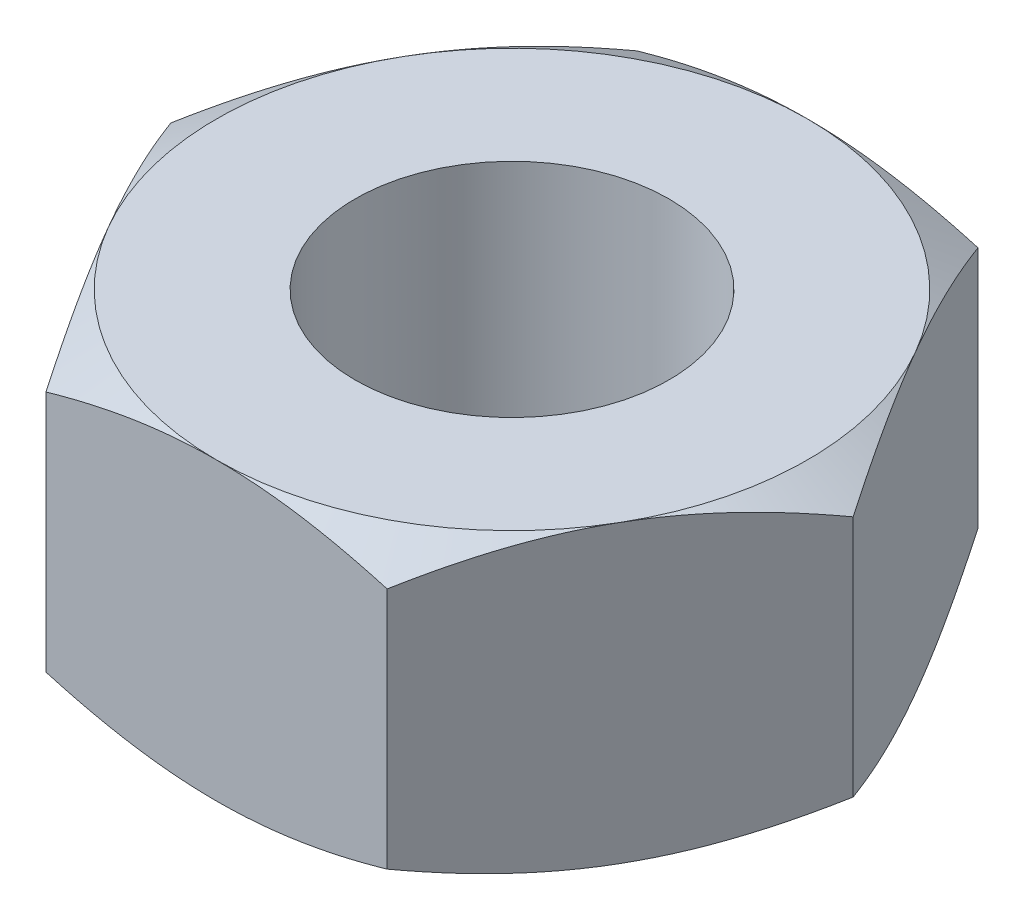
ISO-10303-21;
HEADER;
FILE_DESCRIPTION(('STEP AP214'),'2;1');
FILE_NAME('part.step','',(''),(''),'','','');
FILE_SCHEMA(('AUTOMOTIVE_DESIGN { 1 0 10303 214 1 1 1 1 }'));
ENDSEC;
DATA;
#1=APPLICATION_CONTEXT('core data for automotive mechanical design processes');
#2=APPLICATION_PROTOCOL_DEFINITION('international standard','automotive_design',2000,#1);
#3=PRODUCT_CONTEXT('',#1,'mechanical');
#4=PRODUCT('Part','Part','',(#3));
#5=PRODUCT_RELATED_PRODUCT_CATEGORY('part','',(#4));
#6=PRODUCT_DEFINITION_FORMATION('','',#4);
#7=PRODUCT_DEFINITION_CONTEXT('part definition',#1,'design');
#8=PRODUCT_DEFINITION('design','',#6,#7);
#9=PRODUCT_DEFINITION_SHAPE('','',#8);
#10=(LENGTH_UNIT() NAMED_UNIT(*) SI_UNIT(.MILLI.,.METRE.));
#11=(NAMED_UNIT(*) PLANE_ANGLE_UNIT() SI_UNIT($,.RADIAN.));
#12=(NAMED_UNIT(*) SI_UNIT($,.STERADIAN.) SOLID_ANGLE_UNIT());
#13=UNCERTAINTY_MEASURE_WITH_UNIT(LENGTH_MEASURE(1.E-05),#10,'distance_accuracy_value','');
#14=(GEOMETRIC_REPRESENTATION_CONTEXT(3) GLOBAL_UNCERTAINTY_ASSIGNED_CONTEXT((#13)) GLOBAL_UNIT_ASSIGNED_CONTEXT((#10,
#11,#12)) REPRESENTATION_CONTEXT('',''));
#15=CARTESIAN_POINT('',(0.,0.,0.));
#16=DIRECTION('',(0.,0.,1.));
#17=DIRECTION('',(1.,0.,0.));
#18=AXIS2_PLACEMENT_3D('',#15,#16,#17);
#19=CARTESIAN_POINT('',(5.54256258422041,9.6,9.6));
#20=DIRECTION('',(-0.866025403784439,0.,-0.5));
#21=DIRECTION('',(-0.5,0.,0.866025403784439));
#22=AXIS2_PLACEMENT_3D('',#19,#20,#21);
#23=PLANE('',#22);
#24=CARTESIAN_POINT('',(11.0852406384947,0.857504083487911,-0.000200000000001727));
#25=CARTESIAN_POINT('',(10.9634030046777,0.787172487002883,0.210828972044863));
#26=CARTESIAN_POINT('',(10.8411110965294,0.72003301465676,0.42264477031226));
#27=CARTESIAN_POINT('',(10.5955465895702,0.593024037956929,0.847974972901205));
#28=CARTESIAN_POINT('',(10.4722736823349,0.533156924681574,1.06148991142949));
#29=CARTESIAN_POINT('',(10.1004686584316,0.365622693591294,1.70547510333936));
#30=CARTESIAN_POINT('',(9.8504687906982,0.270329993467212,2.13848757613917));
#31=CARTESIAN_POINT('',(9.4763554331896,0.158590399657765,2.78647091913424));
#32=CARTESIAN_POINT('',(9.35335963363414,0.126759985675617,2.99950589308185));
#33=CARTESIAN_POINT('',(9.10679857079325,0.0733824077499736,3.42656218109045));
#34=CARTESIAN_POINT('',(8.98323329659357,0.0518354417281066,3.64058351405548));
#35=CARTESIAN_POINT('',(8.73589663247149,0.0195768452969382,4.06898318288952));
#36=CARTESIAN_POINT('',(8.61212566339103,0.00885233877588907,4.28336078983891));
#37=CARTESIAN_POINT('',(8.36446939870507,-0.00153345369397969,4.71231402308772));
#38=CARTESIAN_POINT('',(8.24058410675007,-0.00119508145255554,4.92688964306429));
#39=CARTESIAN_POINT('',(8.00897757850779,0.00977525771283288,5.32804391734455));
#40=CARTESIAN_POINT('',(7.90123999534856,0.0190689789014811,5.51465088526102));
#41=CARTESIAN_POINT('',(7.68601680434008,0.0458430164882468,5.8874283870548));
#42=CARTESIAN_POINT('',(7.57853121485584,0.0633239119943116,6.07359888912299));
#43=CARTESIAN_POINT('',(7.25649092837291,0.127634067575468,6.63138902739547));
#44=CARTESIAN_POINT('',(7.04250626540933,0.18632278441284,7.00202133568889));
#45=CARTESIAN_POINT('',(6.61226707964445,0.333045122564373,7.74721746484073));
#46=CARTESIAN_POINT('',(6.39606746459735,0.421700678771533,8.12168618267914));
#47=CARTESIAN_POINT('',(5.96689228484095,0.622911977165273,8.86503939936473));
#48=CARTESIAN_POINT('',(5.7539112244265,0.735420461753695,9.23393341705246));
#49=CARTESIAN_POINT('',(5.54244711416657,0.857504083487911,9.6002));
#50=B_SPLINE_CURVE_WITH_KNOTS('',3,(#24,#25,#26,#27,#28,#29,#30,#31,#32,#33,#34,#35,#36,#37,#38,
#39,#40,#41,#42,#43,#44,#45,#46,#47,#48,#49),.UNSPECIFIED.,.F.,.F.,(4,2,2,2,2,2,2,2,2,2,2,2,4),
(0.,0.760805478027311,1.52186042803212,3.04721013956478,3.7911642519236,4.53513268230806,
5.27821492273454,6.02127420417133,6.66813947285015,7.31505050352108,8.60979186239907,
9.93324753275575,11.2541052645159),.UNSPECIFIED.);
#51=CARTESIAN_POINT('',(11.0851251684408,0.857437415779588,0.));
#52=VERTEX_POINT('',#51);
#53=CARTESIAN_POINT('',(8.31384387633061,0.,4.8));
#54=VERTEX_POINT('',#53);
#55=EDGE_CURVE('E61',#52,#54,#50,.T.);
#56=ORIENTED_EDGE('',*,*,#55,.F.);
#57=DIRECTION('',(0.,-1.,0.));
#58=VECTOR('',#57,1.);
#59=CARTESIAN_POINT('',(11.0851251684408,9.6,0.));
#60=LINE('',#59,#58);
#61=CARTESIAN_POINT('',(11.0851251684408,8.74256258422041,0.));
#62=VERTEX_POINT('',#61);
#63=EDGE_CURVE('E178',#62,#52,#60,.T.);
#64=ORIENTED_EDGE('',*,*,#63,.F.);
#65=CARTESIAN_POINT('',(5.54244711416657,8.74249591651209,9.6002));
#66=CARTESIAN_POINT('',(5.66428474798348,8.81282751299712,9.38917102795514));
#67=CARTESIAN_POINT('',(5.78657665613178,8.87996698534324,9.17735522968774));
#68=CARTESIAN_POINT('',(6.03214116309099,9.00697596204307,8.7520250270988));
#69=CARTESIAN_POINT('',(6.1554140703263,9.06684307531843,8.5385100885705));
#70=CARTESIAN_POINT('',(6.5272190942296,9.2343773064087,7.89452489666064));
#71=CARTESIAN_POINT('',(6.77721896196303,9.32967000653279,7.46151242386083));
#72=CARTESIAN_POINT('',(7.15133231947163,9.44140960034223,6.81352908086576));
#73=CARTESIAN_POINT('',(7.27432811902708,9.47324001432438,6.60049410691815));
#74=CARTESIAN_POINT('',(7.52088918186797,9.52661759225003,6.17343781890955));
#75=CARTESIAN_POINT('',(7.64445445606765,9.54816455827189,5.95941648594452));
#76=CARTESIAN_POINT('',(7.89179112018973,9.58042315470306,5.53101681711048));
#77=CARTESIAN_POINT('',(8.01556208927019,9.59114766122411,5.31663921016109));
#78=CARTESIAN_POINT('',(8.26321835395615,9.60153345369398,4.88768597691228));
#79=CARTESIAN_POINT('',(8.38710364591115,9.60119508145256,4.67311035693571));
#80=CARTESIAN_POINT('',(8.61871017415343,9.59022474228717,4.27195608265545));
#81=CARTESIAN_POINT('',(8.72644775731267,9.58093102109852,4.08534911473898));
#82=CARTESIAN_POINT('',(8.94167094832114,9.55415698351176,3.7125716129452));
#83=CARTESIAN_POINT('',(9.04915653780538,9.53667608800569,3.526401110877));
#84=CARTESIAN_POINT('',(9.37119682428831,9.47236593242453,2.96861097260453));
#85=CARTESIAN_POINT('',(9.58518148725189,9.41367721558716,2.5979786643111));
#86=CARTESIAN_POINT('',(10.0154206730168,9.26695487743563,1.85278253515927));
#87=CARTESIAN_POINT('',(10.2316202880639,9.17829932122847,1.47831381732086));
#88=CARTESIAN_POINT('',(10.6607954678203,8.97708802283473,0.734960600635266));
#89=CARTESIAN_POINT('',(10.8737765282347,8.86457953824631,0.36606658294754));
#90=CARTESIAN_POINT('',(11.0852406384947,8.74249591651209,-0.000200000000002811));
#91=B_SPLINE_CURVE_WITH_KNOTS('',3,(#65,#66,#67,#68,#69,#70,#71,#72,#73,#74,#75,#76,#77,#78,#79,
#80,#81,#82,#83,#84,#85,#86,#87,#88,#89,#90),.UNSPECIFIED.,.F.,.F.,(4,2,2,2,2,2,2,2,2,2,2,2,4),
(0.,0.760805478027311,1.52186042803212,3.04721013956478,3.7911642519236,4.53513268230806,
5.27821492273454,6.02127420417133,6.66813947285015,7.31505050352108,8.60979186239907,
9.93324753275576,11.2541052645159),.UNSPECIFIED.);
#92=CARTESIAN_POINT('',(8.31384387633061,9.6,4.8));
#93=VERTEX_POINT('',#92);
#94=EDGE_CURVE('E251',#93,#62,#91,.T.);
#95=ORIENTED_EDGE('',*,*,#94,.F.);
#96=CARTESIAN_POINT('',(5.54256258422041,8.74256258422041,9.6));
#97=VERTEX_POINT('',#96);
#98=EDGE_CURVE('E169',#97,#93,#91,.T.);
#99=ORIENTED_EDGE('',*,*,#98,.F.);
#100=DIRECTION('',(0.,-1.,0.));
#101=VECTOR('',#100,1.);
#102=CARTESIAN_POINT('',(5.54256258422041,9.6,9.6));
#103=LINE('',#102,#101);
#104=CARTESIAN_POINT('',(5.54256258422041,0.857437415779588,9.6));
#105=VERTEX_POINT('',#104);
#106=EDGE_CURVE('E164',#97,#105,#103,.T.);
#107=ORIENTED_EDGE('',*,*,#106,.T.);
#108=EDGE_CURVE('E156',#54,#105,#50,.T.);
#109=ORIENTED_EDGE('',*,*,#108,.F.);
#110=EDGE_LOOP('',(#56,#64,#95,#99,#107,#109));
#111=FACE_BOUND('',#110,.T.);
#112=ADVANCED_FACE('F45',(#111),#23,.F.);
#113=CARTESIAN_POINT('',(11.0851251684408,9.6,0.));
#114=DIRECTION('',(-0.866025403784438,0.,0.5));
#115=DIRECTION('',(0.5,0.,0.866025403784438));
#116=AXIS2_PLACEMENT_3D('',#113,#114,#115);
#117=PLANE('',#116);
#118=CARTESIAN_POINT('',(5.54244711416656,0.857504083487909,-9.6002));
#119=CARTESIAN_POINT('',(5.66428474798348,0.787172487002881,-9.38917102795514));
#120=CARTESIAN_POINT('',(5.78657665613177,0.720033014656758,-9.17735522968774));
#121=CARTESIAN_POINT('',(6.03214116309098,0.593024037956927,-8.7520250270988));
#122=CARTESIAN_POINT('',(6.15541407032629,0.533156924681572,-8.53851008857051));
#123=CARTESIAN_POINT('',(6.52721909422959,0.365622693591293,-7.89452489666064));
#124=CARTESIAN_POINT('',(6.77721896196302,0.270329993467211,-7.46151242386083));
#125=CARTESIAN_POINT('',(7.15133231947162,0.158590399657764,-6.81352908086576));
#126=CARTESIAN_POINT('',(7.27432811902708,0.126759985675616,-6.60049410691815));
#127=CARTESIAN_POINT('',(7.52088918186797,0.0733824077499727,-6.17343781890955));
#128=CARTESIAN_POINT('',(7.64445445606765,0.0518354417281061,-5.95941648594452));
#129=CARTESIAN_POINT('',(7.89179112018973,0.0195768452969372,-5.53101681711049));
#130=CARTESIAN_POINT('',(8.01556208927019,0.00885233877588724,-5.31663921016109));
#131=CARTESIAN_POINT('',(8.26321835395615,-0.00153345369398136,-4.88768597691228));
#132=CARTESIAN_POINT('',(8.38710364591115,-0.00119508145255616,-4.67311035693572));
#133=CARTESIAN_POINT('',(8.61871017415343,0.00977525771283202,-4.27195608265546));
#134=CARTESIAN_POINT('',(8.72644775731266,0.0190689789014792,-4.08534911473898));
#135=CARTESIAN_POINT('',(8.94167094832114,0.0458430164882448,-3.7125716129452));
#136=CARTESIAN_POINT('',(9.04915653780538,0.0633239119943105,-3.52640111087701));
#137=CARTESIAN_POINT('',(9.37119682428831,0.127634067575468,-2.96861097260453));
#138=CARTESIAN_POINT('',(9.58518148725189,0.186322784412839,-2.59797866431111));
#139=CARTESIAN_POINT('',(10.0154206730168,0.333045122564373,-1.85278253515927));
#140=CARTESIAN_POINT('',(10.2316202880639,0.421700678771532,-1.47831381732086));
#141=CARTESIAN_POINT('',(10.6607954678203,0.622911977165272,-0.73496060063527));
#142=CARTESIAN_POINT('',(10.8737765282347,0.735420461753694,-0.366066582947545));
#143=CARTESIAN_POINT('',(11.0852406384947,0.85750408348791,0.000199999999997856));
#144=B_SPLINE_CURVE_WITH_KNOTS('',3,(#118,#119,#120,#121,#122,#123,#124,#125,#126,#127,#128,
#129,#130,#131,#132,#133,#134,#135,#136,#137,#138,#139,#140,#141,#142,#143),.UNSPECIFIED.,.F.,
.F.,(4,2,2,2,2,2,2,2,2,2,2,2,4),(0.,0.76080547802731,1.52186042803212,3.04721013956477,
3.7911642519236,4.53513268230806,5.27821492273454,6.02127420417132,6.66813947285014,
7.31505050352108,8.60979186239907,9.93324753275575,11.2541052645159),.UNSPECIFIED.);
#145=CARTESIAN_POINT('',(5.5425625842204,0.857437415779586,-9.6));
#146=VERTEX_POINT('',#145);
#147=CARTESIAN_POINT('',(8.31384387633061,0.,-4.8));
#148=VERTEX_POINT('',#147);
#149=EDGE_CURVE('E68',#146,#148,#144,.T.);
#150=ORIENTED_EDGE('',*,*,#149,.F.);
#151=DIRECTION('',(0.,-1.,0.));
#152=VECTOR('',#151,1.);
#153=CARTESIAN_POINT('',(5.5425625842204,9.6,-9.6));
#154=LINE('',#153,#152);
#155=CARTESIAN_POINT('',(5.5425625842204,8.74256258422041,-9.6));
#156=VERTEX_POINT('',#155);
#157=EDGE_CURVE('E175',#156,#146,#154,.T.);
#158=ORIENTED_EDGE('',*,*,#157,.F.);
#159=CARTESIAN_POINT('',(11.0852406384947,8.74249591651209,0.000199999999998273));
#160=CARTESIAN_POINT('',(10.9634030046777,8.81282751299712,-0.210828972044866));
#161=CARTESIAN_POINT('',(10.8411110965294,8.87996698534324,-0.422644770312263));
#162=CARTESIAN_POINT('',(10.5955465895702,9.00697596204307,-0.847974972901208));
#163=CARTESIAN_POINT('',(10.4722736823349,9.06684307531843,-1.0614899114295));
#164=CARTESIAN_POINT('',(10.1004686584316,9.23437730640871,-1.70547510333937));
#165=CARTESIAN_POINT('',(9.8504687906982,9.32967000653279,-2.13848757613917));
#166=CARTESIAN_POINT('',(9.4763554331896,9.44140960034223,-2.78647091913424));
#167=CARTESIAN_POINT('',(9.35335963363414,9.47324001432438,-2.99950589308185));
#168=CARTESIAN_POINT('',(9.10679857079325,9.52661759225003,-3.42656218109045));
#169=CARTESIAN_POINT('',(8.98323329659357,9.5481645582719,-3.64058351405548));
#170=CARTESIAN_POINT('',(8.73589663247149,9.58042315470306,-4.06898318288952));
#171=CARTESIAN_POINT('',(8.61212566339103,9.59114766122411,-4.28336078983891));
#172=CARTESIAN_POINT('',(8.36446939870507,9.60153345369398,-4.71231402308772));
#173=CARTESIAN_POINT('',(8.24058410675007,9.60119508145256,-4.92688964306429));
#174=CARTESIAN_POINT('',(8.00897757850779,9.59022474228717,-5.32804391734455));
#175=CARTESIAN_POINT('',(7.90123999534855,9.58093102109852,-5.51465088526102));
#176=CARTESIAN_POINT('',(7.68601680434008,9.55415698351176,-5.8874283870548));
#177=CARTESIAN_POINT('',(7.57853121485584,9.53667608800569,-6.07359888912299));
#178=CARTESIAN_POINT('',(7.25649092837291,9.47236593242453,-6.63138902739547));
#179=CARTESIAN_POINT('',(7.04250626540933,9.41367721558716,-7.0020213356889));
#180=CARTESIAN_POINT('',(6.61226707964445,9.26695487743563,-7.74721746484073));
#181=CARTESIAN_POINT('',(6.39606746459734,9.17829932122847,-8.12168618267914));
#182=CARTESIAN_POINT('',(5.96689228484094,8.97708802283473,-8.86503939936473));
#183=CARTESIAN_POINT('',(5.75391122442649,8.86457953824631,-9.23393341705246));
#184=CARTESIAN_POINT('',(5.54244711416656,8.74249591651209,-9.6002));
#185=B_SPLINE_CURVE_WITH_KNOTS('',3,(#159,#160,#161,#162,#163,#164,#165,#166,#167,#168,#169,
#170,#171,#172,#173,#174,#175,#176,#177,#178,#179,#180,#181,#182,#183,#184),.UNSPECIFIED.,.F.,
.F.,(4,2,2,2,2,2,2,2,2,2,2,2,4),(0.,0.760805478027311,1.52186042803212,3.04721013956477,
3.7911642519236,4.53513268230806,5.27821492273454,6.02127420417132,6.66813947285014,
7.31505050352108,8.60979186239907,9.93324753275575,11.2541052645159),.UNSPECIFIED.);
#186=CARTESIAN_POINT('',(8.31384387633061,9.6,-4.8));
#187=VERTEX_POINT('',#186);
#188=EDGE_CURVE('E313',#187,#156,#185,.T.);
#189=ORIENTED_EDGE('',*,*,#188,.F.);
#190=EDGE_CURVE('E318',#62,#187,#185,.T.);
#191=ORIENTED_EDGE('',*,*,#190,.F.);
#192=ORIENTED_EDGE('',*,*,#63,.T.);
#193=EDGE_CURVE('E295',#148,#52,#144,.T.);
#194=ORIENTED_EDGE('',*,*,#193,.F.);
#195=EDGE_LOOP('',(#150,#158,#189,#191,#192,#194));
#196=FACE_BOUND('',#195,.T.);
#197=ADVANCED_FACE('F306',(#196),#117,.F.);
#198=CARTESIAN_POINT('',(5.5425625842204,9.6,-9.6));
#199=DIRECTION('',(0.,0.,1.));
#200=DIRECTION('',(1.,0.,0.));
#201=AXIS2_PLACEMENT_3D('',#198,#199,#200);
#202=PLANE('',#201);
#203=CARTESIAN_POINT('',(-15.2013738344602,4.83757496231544,-9.6));
#204=CARTESIAN_POINT('',(-14.9903451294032,4.73456201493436,-9.6));
#205=CARTESIAN_POINT('',(-14.7790770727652,4.63203961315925,-9.6));
#206=CARTESIAN_POINT('',(-14.3560124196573,4.42808643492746,-9.6));
#207=CARTESIAN_POINT('',(-14.1442158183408,4.32665566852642,-9.6));
#208=CARTESIAN_POINT('',(-13.5079061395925,4.02414182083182,-9.6));
#209=CARTESIAN_POINT('',(-13.0825310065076,3.82486548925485,-9.6));
#210=CARTESIAN_POINT('',(-12.2268682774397,3.43127147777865,-9.6));
#211=CARTESIAN_POINT('',(-11.7965667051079,3.2369841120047,-9.6));
#212=CARTESIAN_POINT('',(-10.9326491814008,2.85595090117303,-9.6));
#213=CARTESIAN_POINT('',(-10.4990333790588,2.66920471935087,-9.6));
#214=CARTESIAN_POINT('',(-9.61274788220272,2.29895256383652,-9.6));
#215=CARTESIAN_POINT('',(-9.15993752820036,2.11578152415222,-9.6));
#216=CARTESIAN_POINT('',(-8.24913752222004,1.76255874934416,-9.6));
#217=CARTESIAN_POINT('',(-7.79114731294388,1.59250844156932,-9.6));
#218=CARTESIAN_POINT('',(-6.87001348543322,1.26976322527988,-9.6));
#219=CARTESIAN_POINT('',(-6.40688139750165,1.11703574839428,-9.6));
#220=CARTESIAN_POINT('',(-5.47399741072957,0.833626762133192,-9.6));
#221=CARTESIAN_POINT('',(-5.00424754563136,0.702938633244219,-9.6));
#222=CARTESIAN_POINT('',(-4.06040445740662,0.470374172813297,-9.6));
#223=CARTESIAN_POINT('',(-3.58635282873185,0.368333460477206,-9.6));
#224=CARTESIAN_POINT('',(-2.87071926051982,0.241019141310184,-9.6));
#225=CARTESIAN_POINT('',(-2.63140035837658,0.202870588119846,-9.6));
#226=CARTESIAN_POINT('',(-2.15146956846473,0.135895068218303,-9.6));
#227=CARTESIAN_POINT('',(-1.9108578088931,0.107067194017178,-9.6));
#228=CARTESIAN_POINT('',(-1.43194262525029,0.0596860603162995,-9.6));
#229=CARTESIAN_POINT('',(-1.19365262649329,0.0409976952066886,-9.6));
#230=CARTESIAN_POINT('',(-0.716494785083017,0.0137254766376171,-9.6));
#231=CARTESIAN_POINT('',(-0.477626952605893,0.00514144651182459,-9.6));
#232=CARTESIAN_POINT('',(0.000260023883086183,-0.00171577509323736,-9.6));
#233=CARTESIAN_POINT('',(0.239279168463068,1.10723737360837E-05,-9.6));
#234=CARTESIAN_POINT('',(0.71702524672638,0.0137303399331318,-9.6));
#235=CARTESIAN_POINT('',(0.955752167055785,0.0257232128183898,-9.6));
#236=CARTESIAN_POINT('',(1.52017798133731,0.0659538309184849,-9.6));
#237=CARTESIAN_POINT('',(1.84557405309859,0.0985438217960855,-9.6));
#238=CARTESIAN_POINT('',(2.49413805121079,0.181087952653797,-9.6));
#239=CARTESIAN_POINT('',(2.81730570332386,0.231044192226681,-9.6));
#240=CARTESIAN_POINT('',(3.78298249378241,0.404328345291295,-9.6));
#241=CARTESIAN_POINT('',(4.42136044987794,0.551046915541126,-9.6));
#242=CARTESIAN_POINT('',(5.37653335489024,0.807897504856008,-9.6));
#243=CARTESIAN_POINT('',(5.69821161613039,0.900935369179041,-9.6));
#244=CARTESIAN_POINT('',(6.33845049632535,1.09727791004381,-9.6));
#245=CARTESIAN_POINT('',(6.65701109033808,1.20058266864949,-9.6));
#246=CARTESIAN_POINT('',(7.29110739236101,1.41575205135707,-9.6));
#247=CARTESIAN_POINT('',(7.6066438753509,1.5276144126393,-9.6));
#248=CARTESIAN_POINT('',(8.2350591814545,1.75852289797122,-9.6));
#249=CARTESIAN_POINT('',(8.5479380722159,1.87756883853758,-9.6));
#250=CARTESIAN_POINT('',(9.41025984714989,2.21520236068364,-9.6));
#251=CARTESIAN_POINT('',(9.95721115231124,2.44014832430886,-9.6));
#252=CARTESIAN_POINT('',(11.0452693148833,2.90380830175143,-9.6));
#253=CARTESIAN_POINT('',(11.5863754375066,3.14252402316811,-9.6));
#254=CARTESIAN_POINT('',(12.6641310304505,3.63037481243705,-9.6));
#255=CARTESIAN_POINT('',(13.2007785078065,3.87951426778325,-9.6));
#256=CARTESIAN_POINT('',(14.2703129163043,4.38564793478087,-9.6));
#257=CARTESIAN_POINT('',(14.8032000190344,4.64264178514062,-9.6));
#258=CARTESIAN_POINT('',(15.8669016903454,5.16318115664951,-9.6));
#259=CARTESIAN_POINT('',(16.3977110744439,5.42673724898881,-9.6));
#260=CARTESIAN_POINT('',(17.4569080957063,5.95867562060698,-9.6));
#261=CARTESIAN_POINT('',(17.9852957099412,6.22705794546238,-9.6));
#262=CARTESIAN_POINT('',(19.039962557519,6.76761304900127,-9.6));
#263=CARTESIAN_POINT('',(19.5662422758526,7.03978488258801,-9.6));
#264=CARTESIAN_POINT('',(20.6171722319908,7.58725828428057,-9.6));
#265=CARTESIAN_POINT('',(21.1418224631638,7.86255986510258,-9.6));
#266=CARTESIAN_POINT('',(22.5981746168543,8.63128916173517,-9.6));
#267=CARTESIAN_POINT('',(23.5284160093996,9.12748319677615,-9.6));
#268=CARTESIAN_POINT('',(25.3858281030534,10.125724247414,-9.6));
#269=CARTESIAN_POINT('',(26.3129985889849,10.6277716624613,-9.6));
#270=CARTESIAN_POINT('',(28.1616714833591,11.6344152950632,-9.6));
#271=CARTESIAN_POINT('',(29.0831823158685,12.138996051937,-9.6));
#272=CARTESIAN_POINT('',(30.4640465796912,12.8983212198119,-9.6));
#273=CARTESIAN_POINT('',(30.9240815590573,13.1518278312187,-9.6));
#274=CARTESIAN_POINT('',(31.8437463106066,13.6595737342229,-9.6));
#275=CARTESIAN_POINT('',(32.3033760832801,13.9138130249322,-9.6));
#276=CARTESIAN_POINT('',(32.7628283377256,14.1683727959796,-9.6));
#277=B_SPLINE_CURVE_WITH_KNOTS('',3,(#203,#204,#205,#206,#207,#208,#209,#210,#211,#212,#213,
#214,#215,#216,#217,#218,#219,#220,#221,#222,#223,#224,#225,#226,#227,#228,#229,#230,#231,#232,
#233,#234,#235,#236,#237,#238,#239,#240,#241,#242,#243,#244,#245,#246,#247,#248,#249,#250,#251,
#252,#253,#254,#255,#256,#257,#258,#259,#260,#261,#262,#263,#264,#265,#266,#267,#268,#269,#270,
#271,#272,#273,#274,#275,#276),.UNSPECIFIED.,.F.,.F.,(4,2,2,2,2,2,2,2,2,2,2,2,2,2,2,2,2,2,2,2,2,
2,2,2,2,2,2,2,2,2,2,2,2,2,2,2,4),(0.,0.70448660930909,1.40897970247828,2.81815899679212,
4.23449320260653,5.65076408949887,7.11597287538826,8.58134083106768,10.0439064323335,
11.5060319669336,12.9595877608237,13.6864560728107,14.4132535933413,15.1301128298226,
15.8469595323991,16.5638089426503,17.2806899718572,18.261214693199,19.2418580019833,
21.204058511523,22.2085534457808,23.213056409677,24.2172946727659,25.2215072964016,
26.9954264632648,28.7695660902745,30.5444601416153,32.3192726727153,34.0971574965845,
35.875059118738,37.6525250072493,39.4299981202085,42.5928783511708,45.7559757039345,
48.9077999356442,50.4835786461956,52.0593554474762),.UNSPECIFIED.);
#278=CARTESIAN_POINT('',(-5.54256258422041,0.857437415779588,-9.6));
#279=VERTEX_POINT('',#278);
#280=CARTESIAN_POINT('',(0.,0.,-9.6));
#281=VERTEX_POINT('',#280);
#282=EDGE_CURVE('E327',#279,#281,#277,.T.);
#283=ORIENTED_EDGE('',*,*,#282,.F.);
#284=DIRECTION('',(0.,-1.,0.));
#285=VECTOR('',#284,1.);
#286=CARTESIAN_POINT('',(-5.54256258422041,9.6,-9.6));
#287=LINE('',#286,#285);
#288=CARTESIAN_POINT('',(-5.54256258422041,8.74256258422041,-9.6));
#289=VERTEX_POINT('',#288);
#290=EDGE_CURVE('E166',#289,#279,#287,.T.);
#291=ORIENTED_EDGE('',*,*,#290,.F.);
#292=CARTESIAN_POINT('',(-15.2013738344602,4.76242503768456,-9.6));
#293=CARTESIAN_POINT('',(-14.9903451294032,4.86543798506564,-9.6));
#294=CARTESIAN_POINT('',(-14.7790770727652,4.96796038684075,-9.6));
#295=CARTESIAN_POINT('',(-14.3560124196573,5.17191356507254,-9.6));
#296=CARTESIAN_POINT('',(-14.1442158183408,5.27334433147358,-9.6));
#297=CARTESIAN_POINT('',(-13.5079061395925,5.57585817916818,-9.6));
#298=CARTESIAN_POINT('',(-13.0825310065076,5.77513451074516,-9.6));
#299=CARTESIAN_POINT('',(-12.2268682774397,6.16872852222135,-9.6));
#300=CARTESIAN_POINT('',(-11.7965667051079,6.3630158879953,-9.6));
#301=CARTESIAN_POINT('',(-10.9326491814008,6.74404909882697,-9.6));
#302=CARTESIAN_POINT('',(-10.4990333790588,6.93079528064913,-9.6));
#303=CARTESIAN_POINT('',(-9.61274788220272,7.30104743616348,-9.6));
#304=CARTESIAN_POINT('',(-9.15993752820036,7.48421847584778,-9.6));
#305=CARTESIAN_POINT('',(-8.24913752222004,7.83744125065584,-9.6));
#306=CARTESIAN_POINT('',(-7.79114731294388,8.00749155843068,-9.6));
#307=CARTESIAN_POINT('',(-6.87001348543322,8.33023677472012,-9.6));
#308=CARTESIAN_POINT('',(-6.40688139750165,8.48296425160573,-9.6));
#309=CARTESIAN_POINT('',(-5.47399741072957,8.76637323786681,-9.6));
#310=CARTESIAN_POINT('',(-5.00424754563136,8.89706136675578,-9.6));
#311=CARTESIAN_POINT('',(-4.06040445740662,9.1296258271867,-9.6));
#312=CARTESIAN_POINT('',(-3.58635282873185,9.2316665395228,-9.6));
#313=CARTESIAN_POINT('',(-2.87071926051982,9.35898085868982,-9.6));
#314=CARTESIAN_POINT('',(-2.63140035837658,9.39712941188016,-9.6));
#315=CARTESIAN_POINT('',(-2.15146956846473,9.4641049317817,-9.6));
#316=CARTESIAN_POINT('',(-1.91085780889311,9.49293280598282,-9.6));
#317=CARTESIAN_POINT('',(-1.43194262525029,9.5403139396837,-9.6));
#318=CARTESIAN_POINT('',(-1.19365262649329,9.55900230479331,-9.6));
#319=CARTESIAN_POINT('',(-0.716494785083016,9.58627452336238,-9.6));
#320=CARTESIAN_POINT('',(-0.477626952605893,9.59485855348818,-9.6));
#321=CARTESIAN_POINT('',(0.000260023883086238,9.60171577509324,-9.6));
#322=CARTESIAN_POINT('',(0.239279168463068,9.59998892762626,-9.6));
#323=CARTESIAN_POINT('',(0.71702524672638,9.58626966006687,-9.6));
#324=CARTESIAN_POINT('',(0.955752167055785,9.57427678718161,-9.6));
#325=CARTESIAN_POINT('',(1.52017798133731,9.53404616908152,-9.6));
#326=CARTESIAN_POINT('',(1.84557405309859,9.50145617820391,-9.6));
#327=CARTESIAN_POINT('',(2.49413805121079,9.4189120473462,-9.6));
#328=CARTESIAN_POINT('',(2.81730570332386,9.36895580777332,-9.6));
#329=CARTESIAN_POINT('',(3.78298249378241,9.19567165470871,-9.6));
#330=CARTESIAN_POINT('',(4.42136044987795,9.04895308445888,-9.6));
#331=CARTESIAN_POINT('',(5.37653335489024,8.79210249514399,-9.6));
#332=CARTESIAN_POINT('',(5.69821161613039,8.69906463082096,-9.6));
#333=CARTESIAN_POINT('',(6.33845049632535,8.50272208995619,-9.6));
#334=CARTESIAN_POINT('',(6.65701109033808,8.39941733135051,-9.6));
#335=CARTESIAN_POINT('',(7.29110739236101,8.18424794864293,-9.6));
#336=CARTESIAN_POINT('',(7.6066438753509,8.0723855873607,-9.6));
#337=CARTESIAN_POINT('',(8.2350591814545,7.84147710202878,-9.6));
#338=CARTESIAN_POINT('',(8.5479380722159,7.72243116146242,-9.6));
#339=CARTESIAN_POINT('',(9.4102598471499,7.38479763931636,-9.6));
#340=CARTESIAN_POINT('',(9.95721115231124,7.15985167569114,-9.6));
#341=CARTESIAN_POINT('',(11.0452693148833,6.69619169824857,-9.6));
#342=CARTESIAN_POINT('',(11.5863754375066,6.45747597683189,-9.6));
#343=CARTESIAN_POINT('',(12.6641310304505,5.96962518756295,-9.6));
#344=CARTESIAN_POINT('',(13.2007785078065,5.72048573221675,-9.6));
#345=CARTESIAN_POINT('',(14.2703129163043,5.21435206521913,-9.6));
#346=CARTESIAN_POINT('',(14.8032000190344,4.95735821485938,-9.6));
#347=CARTESIAN_POINT('',(15.8669016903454,4.43681884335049,-9.6));
#348=CARTESIAN_POINT('',(16.3977110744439,4.17326275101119,-9.6));
#349=CARTESIAN_POINT('',(17.4569080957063,3.64132437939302,-9.6));
#350=CARTESIAN_POINT('',(17.9852957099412,3.37294205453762,-9.6));
#351=CARTESIAN_POINT('',(19.039962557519,2.83238695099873,-9.6));
#352=CARTESIAN_POINT('',(19.5662422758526,2.56021511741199,-9.6));
#353=CARTESIAN_POINT('',(20.6171722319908,2.01274171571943,-9.6));
#354=CARTESIAN_POINT('',(21.1418224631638,1.73744013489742,-9.6));
#355=CARTESIAN_POINT('',(22.5981746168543,0.968710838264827,-9.6));
#356=CARTESIAN_POINT('',(23.5284160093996,0.472516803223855,-9.6));
#357=CARTESIAN_POINT('',(25.3858281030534,-0.525724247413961,-9.6));
#358=CARTESIAN_POINT('',(26.3129985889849,-1.02777166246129,-9.6));
#359=CARTESIAN_POINT('',(28.1616714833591,-2.03441529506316,-9.6));
#360=CARTESIAN_POINT('',(29.0831823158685,-2.53899605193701,-9.6));
#361=CARTESIAN_POINT('',(30.4640465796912,-3.29832121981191,-9.6));
#362=CARTESIAN_POINT('',(30.9240815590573,-3.55182783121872,-9.6));
#363=CARTESIAN_POINT('',(31.8437463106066,-4.05957373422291,-9.6));
#364=CARTESIAN_POINT('',(32.3033760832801,-4.31381302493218,-9.6));
#365=CARTESIAN_POINT('',(32.7628283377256,-4.56837279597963,-9.6));
#366=B_SPLINE_CURVE_WITH_KNOTS('',3,(#292,#293,#294,#295,#296,#297,#298,#299,#300,#301,#302,
#303,#304,#305,#306,#307,#308,#309,#310,#311,#312,#313,#314,#315,#316,#317,#318,#319,#320,#321,
#322,#323,#324,#325,#326,#327,#328,#329,#330,#331,#332,#333,#334,#335,#336,#337,#338,#339,#340,
#341,#342,#343,#344,#345,#346,#347,#348,#349,#350,#351,#352,#353,#354,#355,#356,#357,#358,#359,
#360,#361,#362,#363,#364,#365),.UNSPECIFIED.,.F.,.F.,(4,2,2,2,2,2,2,2,2,2,2,2,2,2,2,2,2,2,2,2,2,
2,2,2,2,2,2,2,2,2,2,2,2,2,2,2,4),(0.,0.70448660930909,1.40897970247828,2.81815899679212,
4.23449320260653,5.65076408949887,7.11597287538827,8.58134083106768,10.0439064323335,
11.5060319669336,12.9595877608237,13.6864560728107,14.4132535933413,15.1301128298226,
15.846959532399,16.5638089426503,17.2806899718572,18.261214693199,19.2418580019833,
21.204058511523,22.2085534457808,23.213056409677,24.2172946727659,25.2215072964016,
26.9954264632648,28.7695660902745,30.5444601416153,32.3192726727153,34.0971574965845,
35.875059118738,37.6525250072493,39.4299981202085,42.5928783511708,45.7559757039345,
48.9077999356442,50.4835786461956,52.0593554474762),.UNSPECIFIED.);
#367=CARTESIAN_POINT('',(0.,9.6,-9.6));
#368=VERTEX_POINT('',#367);
#369=EDGE_CURVE('E214',#368,#289,#366,.F.);
#370=ORIENTED_EDGE('',*,*,#369,.F.);
#371=EDGE_CURVE('E319',#156,#368,#366,.F.);
#372=ORIENTED_EDGE('',*,*,#371,.F.);
#373=ORIENTED_EDGE('',*,*,#157,.T.);
#374=EDGE_CURVE('E301',#281,#146,#277,.T.);
#375=ORIENTED_EDGE('',*,*,#374,.F.);
#376=EDGE_LOOP('',(#283,#291,#370,#372,#373,#375));
#377=FACE_BOUND('',#376,.T.);
#378=ADVANCED_FACE('F309',(#377),#202,.F.);
#379=CARTESIAN_POINT('',(-5.54256258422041,9.6,-9.6));
#380=DIRECTION('',(0.866025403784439,0.,0.5));
#381=DIRECTION('',(0.5,0.,-0.866025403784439));
#382=AXIS2_PLACEMENT_3D('',#379,#380,#381);
#383=PLANE('',#382);
#384=CARTESIAN_POINT('',(-11.0852406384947,0.857504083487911,0.000200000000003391));
#385=CARTESIAN_POINT('',(-10.9634030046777,0.787172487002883,-0.210828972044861));
#386=CARTESIAN_POINT('',(-10.8411110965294,0.72003301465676,-0.422644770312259));
#387=CARTESIAN_POINT('',(-10.5955465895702,0.593024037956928,-0.847974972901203));
#388=CARTESIAN_POINT('',(-10.4722736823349,0.533156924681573,-1.06148991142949));
#389=CARTESIAN_POINT('',(-10.1004686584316,0.365622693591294,-1.70547510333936));
#390=CARTESIAN_POINT('',(-9.8504687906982,0.270329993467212,-2.13848757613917));
#391=CARTESIAN_POINT('',(-9.4763554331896,0.158590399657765,-2.78647091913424));
#392=CARTESIAN_POINT('',(-9.35335963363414,0.126759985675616,-2.99950589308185));
#393=CARTESIAN_POINT('',(-9.10679857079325,0.0733824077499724,-3.42656218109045));
#394=CARTESIAN_POINT('',(-8.98323329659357,0.0518354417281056,-3.64058351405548));
#395=CARTESIAN_POINT('',(-8.73589663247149,0.0195768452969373,-4.06898318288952));
#396=CARTESIAN_POINT('',(-8.61212566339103,0.008852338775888,-4.28336078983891));
#397=CARTESIAN_POINT('',(-8.36446939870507,-0.00153345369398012,-4.71231402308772));
#398=CARTESIAN_POINT('',(-8.24058410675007,-0.0011950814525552,-4.92688964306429));
#399=CARTESIAN_POINT('',(-8.00897757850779,0.00977525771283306,-5.32804391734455));
#400=CARTESIAN_POINT('',(-7.90123999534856,0.0190689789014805,-5.51465088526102));
#401=CARTESIAN_POINT('',(-7.68601680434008,0.0458430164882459,-5.8874283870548));
#402=CARTESIAN_POINT('',(-7.57853121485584,0.0633239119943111,-6.07359888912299));
#403=CARTESIAN_POINT('',(-7.25649092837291,0.127634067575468,-6.63138902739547));
#404=CARTESIAN_POINT('',(-7.04250626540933,0.18632278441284,-7.00202133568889));
#405=CARTESIAN_POINT('',(-6.61226707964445,0.333045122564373,-7.74721746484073));
#406=CARTESIAN_POINT('',(-6.39606746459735,0.421700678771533,-8.12168618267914));
#407=CARTESIAN_POINT('',(-5.96689228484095,0.622911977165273,-8.86503939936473));
#408=CARTESIAN_POINT('',(-5.7539112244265,0.735420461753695,-9.23393341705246));
#409=CARTESIAN_POINT('',(-5.54244711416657,0.857504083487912,-9.6002));
#410=B_SPLINE_CURVE_WITH_KNOTS('',3,(#384,#385,#386,#387,#388,#389,#390,#391,#392,#393,#394,
#395,#396,#397,#398,#399,#400,#401,#402,#403,#404,#405,#406,#407,#408,#409),.UNSPECIFIED.,.F.,
.F.,(4,2,2,2,2,2,2,2,2,2,2,2,4),(0.,0.760805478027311,1.52186042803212,3.04721013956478,
3.7911642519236,4.53513268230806,5.27821492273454,6.02127420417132,6.66813947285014,
7.31505050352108,8.60979186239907,9.93324753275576,11.2541052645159),.UNSPECIFIED.);
#411=CARTESIAN_POINT('',(-11.0851251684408,0.857437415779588,0.));
#412=VERTEX_POINT('',#411);
#413=CARTESIAN_POINT('',(-8.31384387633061,0.,-4.8));
#414=VERTEX_POINT('',#413);
#415=EDGE_CURVE('E289',#412,#414,#410,.T.);
#416=ORIENTED_EDGE('',*,*,#415,.F.);
#417=DIRECTION('',(0.,-1.,0.));
#418=VECTOR('',#417,1.);
#419=CARTESIAN_POINT('',(-11.0851251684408,9.6,0.));
#420=LINE('',#419,#418);
#421=CARTESIAN_POINT('',(-11.0851251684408,8.74256258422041,0.));
#422=VERTEX_POINT('',#421);
#423=EDGE_CURVE('E163',#422,#412,#420,.T.);
#424=ORIENTED_EDGE('',*,*,#423,.F.);
#425=CARTESIAN_POINT('',(-5.54244711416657,8.74249591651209,-9.6002));
#426=CARTESIAN_POINT('',(-5.66428474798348,8.81282751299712,-9.38917102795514));
#427=CARTESIAN_POINT('',(-5.78657665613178,8.87996698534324,-9.17735522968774));
#428=CARTESIAN_POINT('',(-6.03214116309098,9.00697596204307,-8.75202502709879));
#429=CARTESIAN_POINT('',(-6.1554140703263,9.06684307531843,-8.5385100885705));
#430=CARTESIAN_POINT('',(-6.52721909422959,9.2343773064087,-7.89452489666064));
#431=CARTESIAN_POINT('',(-6.77721896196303,9.32967000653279,-7.46151242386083));
#432=CARTESIAN_POINT('',(-7.15133231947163,9.44140960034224,-6.81352908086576));
#433=CARTESIAN_POINT('',(-7.27432811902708,9.47324001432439,-6.60049410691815));
#434=CARTESIAN_POINT('',(-7.52088918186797,9.52661759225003,-6.17343781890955));
#435=CARTESIAN_POINT('',(-7.64445445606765,9.54816455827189,-5.95941648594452));
#436=CARTESIAN_POINT('',(-7.89179112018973,9.58042315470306,-5.53101681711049));
#437=CARTESIAN_POINT('',(-8.01556208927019,9.59114766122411,-5.31663921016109));
#438=CARTESIAN_POINT('',(-8.26321835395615,9.60153345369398,-4.88768597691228));
#439=CARTESIAN_POINT('',(-8.38710364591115,9.60119508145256,-4.67311035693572));
#440=CARTESIAN_POINT('',(-8.61871017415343,9.59022474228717,-4.27195608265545));
#441=CARTESIAN_POINT('',(-8.72644775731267,9.58093102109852,-4.08534911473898));
#442=CARTESIAN_POINT('',(-8.94167094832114,9.55415698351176,-3.7125716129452));
#443=CARTESIAN_POINT('',(-9.04915653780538,9.53667608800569,-3.52640111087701));
#444=CARTESIAN_POINT('',(-9.37119682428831,9.47236593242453,-2.96861097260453));
#445=CARTESIAN_POINT('',(-9.58518148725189,9.41367721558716,-2.5979786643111));
#446=CARTESIAN_POINT('',(-10.0154206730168,9.26695487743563,-1.85278253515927));
#447=CARTESIAN_POINT('',(-10.2316202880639,9.17829932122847,-1.47831381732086));
#448=CARTESIAN_POINT('',(-10.6607954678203,8.97708802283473,-0.734960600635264));
#449=CARTESIAN_POINT('',(-10.8737765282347,8.86457953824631,-0.366066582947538));
#450=CARTESIAN_POINT('',(-11.0852406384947,8.74249591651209,0.000200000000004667));
#451=B_SPLINE_CURVE_WITH_KNOTS('',3,(#425,#426,#427,#428,#429,#430,#431,#432,#433,#434,#435,
#436,#437,#438,#439,#440,#441,#442,#443,#444,#445,#446,#447,#448,#449,#450),.UNSPECIFIED.,.F.,
.F.,(4,2,2,2,2,2,2,2,2,2,2,2,4),(0.,0.760805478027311,1.52186042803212,3.04721013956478,
3.7911642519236,4.53513268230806,5.27821492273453,6.02127420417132,6.66813947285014,
7.31505050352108,8.60979186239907,9.93324753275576,11.2541052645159),.UNSPECIFIED.);
#452=CARTESIAN_POINT('',(-8.31384387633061,9.6,-4.8));
#453=VERTEX_POINT('',#452);
#454=EDGE_CURVE('E205',#453,#422,#451,.T.);
#455=ORIENTED_EDGE('',*,*,#454,.F.);
#456=EDGE_CURVE('E208',#289,#453,#451,.T.);
#457=ORIENTED_EDGE('',*,*,#456,.F.);
#458=ORIENTED_EDGE('',*,*,#290,.T.);
#459=EDGE_CURVE('E296',#414,#279,#410,.T.);
#460=ORIENTED_EDGE('',*,*,#459,.F.);
#461=EDGE_LOOP('',(#416,#424,#455,#457,#458,#460));
#462=FACE_BOUND('',#461,.T.);
#463=ADVANCED_FACE('F207',(#462),#383,.F.);
#464=CARTESIAN_POINT('',(-11.0851251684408,9.6,0.));
#465=DIRECTION('',(0.866025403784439,0.,-0.5));
#466=DIRECTION('',(-0.5,0.,-0.866025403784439));
#467=AXIS2_PLACEMENT_3D('',#464,#465,#466);
#468=PLANE('',#467);
#469=CARTESIAN_POINT('',(-5.54244711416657,0.85750408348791,9.6002));
#470=CARTESIAN_POINT('',(-5.66428474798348,0.787172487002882,9.38917102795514));
#471=CARTESIAN_POINT('',(-5.78657665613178,0.72003301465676,9.17735522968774));
#472=CARTESIAN_POINT('',(-6.03214116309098,0.593024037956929,8.7520250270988));
#473=CARTESIAN_POINT('',(-6.1554140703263,0.533156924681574,8.53851008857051));
#474=CARTESIAN_POINT('',(-6.52721909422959,0.365622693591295,7.89452489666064));
#475=CARTESIAN_POINT('',(-6.77721896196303,0.270329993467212,7.46151242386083));
#476=CARTESIAN_POINT('',(-7.15133231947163,0.158590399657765,6.81352908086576));
#477=CARTESIAN_POINT('',(-7.27432811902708,0.126759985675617,6.60049410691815));
#478=CARTESIAN_POINT('',(-7.52088918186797,0.0733824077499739,6.17343781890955));
#479=CARTESIAN_POINT('',(-7.64445445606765,0.0518354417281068,5.95941648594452));
#480=CARTESIAN_POINT('',(-7.89179112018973,0.019576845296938,5.53101681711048));
#481=CARTESIAN_POINT('',(-8.01556208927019,0.00885233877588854,5.31663921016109));
#482=CARTESIAN_POINT('',(-8.26321835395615,-0.00153345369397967,4.88768597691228));
#483=CARTESIAN_POINT('',(-8.38710364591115,-0.00119508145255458,4.67311035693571));
#484=CARTESIAN_POINT('',(-8.61871017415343,0.00977525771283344,4.27195608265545));
#485=CARTESIAN_POINT('',(-8.72644775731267,0.0190689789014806,4.08534911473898));
#486=CARTESIAN_POINT('',(-8.94167094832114,0.045843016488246,3.7125716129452));
#487=CARTESIAN_POINT('',(-9.04915653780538,0.0633239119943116,3.52640111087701));
#488=CARTESIAN_POINT('',(-9.37119682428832,0.127634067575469,2.96861097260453));
#489=CARTESIAN_POINT('',(-9.58518148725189,0.18632278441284,2.59797866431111));
#490=CARTESIAN_POINT('',(-10.0154206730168,0.333045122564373,1.85278253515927));
#491=CARTESIAN_POINT('',(-10.2316202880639,0.421700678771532,1.47831381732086));
#492=CARTESIAN_POINT('',(-10.6607954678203,0.622911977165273,0.734960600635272));
#493=CARTESIAN_POINT('',(-10.8737765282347,0.735420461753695,0.366066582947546));
#494=CARTESIAN_POINT('',(-11.0852406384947,0.85750408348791,-0.000199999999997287));
#495=B_SPLINE_CURVE_WITH_KNOTS('',3,(#469,#470,#471,#472,#473,#474,#475,#476,#477,#478,#479,
#480,#481,#482,#483,#484,#485,#486,#487,#488,#489,#490,#491,#492,#493,#494),.UNSPECIFIED.,.F.,
.F.,(4,2,2,2,2,2,2,2,2,2,2,2,4),(0.,0.760805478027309,1.52186042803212,3.04721013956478,
3.7911642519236,4.53513268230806,5.27821492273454,6.02127420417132,6.66813947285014,
7.31505050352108,8.60979186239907,9.93324753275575,11.2541052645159),.UNSPECIFIED.);
#496=CARTESIAN_POINT('',(-5.54256258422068,0.85743741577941,9.6));
#497=VERTEX_POINT('',#496);
#498=CARTESIAN_POINT('',(-8.31384387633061,0.,4.8));
#499=VERTEX_POINT('',#498);
#500=EDGE_CURVE('E139',#497,#499,#495,.T.);
#501=ORIENTED_EDGE('',*,*,#500,.F.);
#502=DIRECTION('',(0.,-1.,0.));
#503=VECTOR('',#502,1.);
#504=CARTESIAN_POINT('',(-5.54256258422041,9.6,9.6));
#505=LINE('',#504,#503);
#506=CARTESIAN_POINT('',(-5.54256258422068,8.74256258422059,9.6));
#507=VERTEX_POINT('',#506);
#508=EDGE_CURVE('E153',#507,#497,#505,.T.);
#509=ORIENTED_EDGE('',*,*,#508,.F.);
#510=CARTESIAN_POINT('',(-11.0852406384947,8.74249591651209,-0.000199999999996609));
#511=CARTESIAN_POINT('',(-10.9634030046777,8.81282751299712,0.210828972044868));
#512=CARTESIAN_POINT('',(-10.8411110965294,8.87996698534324,0.422644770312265));
#513=CARTESIAN_POINT('',(-10.5955465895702,9.00697596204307,0.84797497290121));
#514=CARTESIAN_POINT('',(-10.4722736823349,9.06684307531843,1.0614899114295));
#515=CARTESIAN_POINT('',(-10.1004686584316,9.23437730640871,1.70547510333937));
#516=CARTESIAN_POINT('',(-9.8504687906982,9.32967000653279,2.13848757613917));
#517=CARTESIAN_POINT('',(-9.4763554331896,9.44140960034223,2.78647091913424));
#518=CARTESIAN_POINT('',(-9.35335963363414,9.47324001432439,2.99950589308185));
#519=CARTESIAN_POINT('',(-9.10679857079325,9.52661759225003,3.42656218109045));
#520=CARTESIAN_POINT('',(-8.98323329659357,9.54816455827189,3.64058351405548));
#521=CARTESIAN_POINT('',(-8.73589663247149,9.58042315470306,4.06898318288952));
#522=CARTESIAN_POINT('',(-8.61212566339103,9.59114766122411,4.28336078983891));
#523=CARTESIAN_POINT('',(-8.36446939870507,9.60153345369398,4.71231402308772));
#524=CARTESIAN_POINT('',(-8.24058410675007,9.60119508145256,4.92688964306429));
#525=CARTESIAN_POINT('',(-8.00897757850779,9.59022474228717,5.32804391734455));
#526=CARTESIAN_POINT('',(-7.90123999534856,9.58093102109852,5.51465088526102));
#527=CARTESIAN_POINT('',(-7.68601680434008,9.55415698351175,5.8874283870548));
#528=CARTESIAN_POINT('',(-7.57853121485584,9.53667608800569,6.073598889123));
#529=CARTESIAN_POINT('',(-7.25649092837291,9.47236593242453,6.63138902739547));
#530=CARTESIAN_POINT('',(-7.04250626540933,9.41367721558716,7.0020213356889));
#531=CARTESIAN_POINT('',(-6.61226707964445,9.26695487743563,7.74721746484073));
#532=CARTESIAN_POINT('',(-6.39606746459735,9.17829932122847,8.12168618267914));
#533=CARTESIAN_POINT('',(-5.96689228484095,8.97708802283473,8.86503939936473));
#534=CARTESIAN_POINT('',(-5.7539112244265,8.86457953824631,9.23393341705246));
#535=CARTESIAN_POINT('',(-5.54244711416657,8.74249591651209,9.6002));
#536=B_SPLINE_CURVE_WITH_KNOTS('',3,(#510,#511,#512,#513,#514,#515,#516,#517,#518,#519,#520,
#521,#522,#523,#524,#525,#526,#527,#528,#529,#530,#531,#532,#533,#534,#535),.UNSPECIFIED.,.F.,
.F.,(4,2,2,2,2,2,2,2,2,2,2,2,4),(0.,0.760805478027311,1.52186042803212,3.04721013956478,
3.7911642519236,4.53513268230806,5.27821492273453,6.02127420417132,6.66813947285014,
7.31505050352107,8.60979186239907,9.93324753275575,11.2541052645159),.UNSPECIFIED.);
#537=CARTESIAN_POINT('',(-8.31384387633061,9.6,4.8));
#538=VERTEX_POINT('',#537);
#539=EDGE_CURVE('E215',#538,#507,#536,.T.);
#540=ORIENTED_EDGE('',*,*,#539,.F.);
#541=EDGE_CURVE('E212',#422,#538,#536,.T.);
#542=ORIENTED_EDGE('',*,*,#541,.F.);
#543=ORIENTED_EDGE('',*,*,#423,.T.);
#544=EDGE_CURVE('E155',#499,#412,#495,.T.);
#545=ORIENTED_EDGE('',*,*,#544,.F.);
#546=EDGE_LOOP('',(#501,#509,#540,#542,#543,#545));
#547=FACE_BOUND('',#546,.T.);
#548=ADVANCED_FACE('F151',(#547),#468,.F.);
#549=CARTESIAN_POINT('',(-5.54256258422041,9.6,9.6));
#550=DIRECTION('',(0.,0.,-1.));
#551=DIRECTION('',(-1.,0.,0.));
#552=AXIS2_PLACEMENT_3D('',#549,#550,#551);
#553=PLANE('',#552);
#554=CARTESIAN_POINT('',(-15.2013738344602,4.83757496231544,9.6));
#555=CARTESIAN_POINT('',(-14.9903451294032,4.73456201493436,9.6));
#556=CARTESIAN_POINT('',(-14.7790770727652,4.63203961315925,9.6));
#557=CARTESIAN_POINT('',(-14.3560124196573,4.42808643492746,9.6));
#558=CARTESIAN_POINT('',(-14.1442158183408,4.32665566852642,9.6));
#559=CARTESIAN_POINT('',(-13.5079061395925,4.02414182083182,9.6));
#560=CARTESIAN_POINT('',(-13.0825310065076,3.82486548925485,9.6));
#561=CARTESIAN_POINT('',(-12.2268682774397,3.43127147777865,9.6));
#562=CARTESIAN_POINT('',(-11.7965667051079,3.2369841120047,9.6));
#563=CARTESIAN_POINT('',(-10.9326491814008,2.85595090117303,9.6));
#564=CARTESIAN_POINT('',(-10.4990333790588,2.66920471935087,9.6));
#565=CARTESIAN_POINT('',(-9.61274788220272,2.29895256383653,9.6));
#566=CARTESIAN_POINT('',(-9.15993752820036,2.11578152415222,9.6));
#567=CARTESIAN_POINT('',(-8.24913752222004,1.76255874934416,9.6));
#568=CARTESIAN_POINT('',(-7.79114731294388,1.59250844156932,9.6));
#569=CARTESIAN_POINT('',(-6.87001348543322,1.26976322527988,9.6));
#570=CARTESIAN_POINT('',(-6.40688139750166,1.11703574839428,9.6));
#571=CARTESIAN_POINT('',(-5.47399741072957,0.833626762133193,9.6));
#572=CARTESIAN_POINT('',(-5.00424754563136,0.70293863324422,9.6));
#573=CARTESIAN_POINT('',(-4.06040445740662,0.470374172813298,9.6));
#574=CARTESIAN_POINT('',(-3.58635282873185,0.368333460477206,9.6));
#575=CARTESIAN_POINT('',(-2.87071926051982,0.241019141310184,9.6));
#576=CARTESIAN_POINT('',(-2.63140035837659,0.202870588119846,9.6));
#577=CARTESIAN_POINT('',(-2.15146956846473,0.135895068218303,9.6));
#578=CARTESIAN_POINT('',(-1.91085780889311,0.107067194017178,9.6));
#579=CARTESIAN_POINT('',(-1.43194262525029,0.0596860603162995,9.6));
#580=CARTESIAN_POINT('',(-1.19365262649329,0.0409976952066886,9.6));
#581=CARTESIAN_POINT('',(-0.716494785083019,0.0137254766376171,9.6));
#582=CARTESIAN_POINT('',(-0.477626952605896,0.00514144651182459,9.6));
#583=CARTESIAN_POINT('',(0.000260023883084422,-0.00171577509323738,9.6));
#584=CARTESIAN_POINT('',(0.239279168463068,1.10723737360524E-05,9.6));
#585=CARTESIAN_POINT('',(0.717025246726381,0.0137303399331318,9.6));
#586=CARTESIAN_POINT('',(0.955752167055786,0.0257232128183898,9.6));
#587=CARTESIAN_POINT('',(1.52017798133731,0.0659538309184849,9.6));
#588=CARTESIAN_POINT('',(1.84557405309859,0.0985438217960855,9.6));
#589=CARTESIAN_POINT('',(2.49413805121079,0.181087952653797,9.6));
#590=CARTESIAN_POINT('',(2.81730570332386,0.231044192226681,9.6));
#591=CARTESIAN_POINT('',(3.78298249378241,0.404328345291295,9.6));
#592=CARTESIAN_POINT('',(4.42136044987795,0.551046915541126,9.6));
#593=CARTESIAN_POINT('',(5.37653335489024,0.807897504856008,9.6));
#594=CARTESIAN_POINT('',(5.69821161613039,0.900935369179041,9.6));
#595=CARTESIAN_POINT('',(6.33845049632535,1.09727791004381,9.6));
#596=CARTESIAN_POINT('',(6.65701109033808,1.20058266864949,9.6));
#597=CARTESIAN_POINT('',(7.29110739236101,1.41575205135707,9.6));
#598=CARTESIAN_POINT('',(7.6066438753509,1.5276144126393,9.6));
#599=CARTESIAN_POINT('',(8.2350591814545,1.75852289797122,9.6));
#600=CARTESIAN_POINT('',(8.54793807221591,1.87756883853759,9.6));
#601=CARTESIAN_POINT('',(9.4102598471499,2.21520236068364,9.6));
#602=CARTESIAN_POINT('',(9.95721115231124,2.44014832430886,9.6));
#603=CARTESIAN_POINT('',(11.0452693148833,2.90380830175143,9.6));
#604=CARTESIAN_POINT('',(11.5863754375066,3.14252402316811,9.6));
#605=CARTESIAN_POINT('',(12.6641310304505,3.63037481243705,9.6));
#606=CARTESIAN_POINT('',(13.2007785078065,3.87951426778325,9.6));
#607=CARTESIAN_POINT('',(14.2703129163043,4.38564793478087,9.6));
#608=CARTESIAN_POINT('',(14.8032000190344,4.64264178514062,9.6));
#609=CARTESIAN_POINT('',(15.8669016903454,5.16318115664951,9.6));
#610=CARTESIAN_POINT('',(16.3977110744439,5.42673724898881,9.6));
#611=CARTESIAN_POINT('',(17.4569080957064,5.95867562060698,9.6));
#612=CARTESIAN_POINT('',(17.9852957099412,6.22705794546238,9.6));
#613=CARTESIAN_POINT('',(19.039962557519,6.76761304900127,9.6));
#614=CARTESIAN_POINT('',(19.5662422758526,7.03978488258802,9.6));
#615=CARTESIAN_POINT('',(20.6171722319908,7.58725828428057,9.6));
#616=CARTESIAN_POINT('',(21.1418224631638,7.86255986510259,9.6));
#617=CARTESIAN_POINT('',(22.5981746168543,8.63128916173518,9.6));
#618=CARTESIAN_POINT('',(23.5284160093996,9.12748319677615,9.6));
#619=CARTESIAN_POINT('',(25.3858281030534,10.125724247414,9.6));
#620=CARTESIAN_POINT('',(26.3129985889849,10.6277716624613,9.6));
#621=CARTESIAN_POINT('',(28.1616714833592,11.6344152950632,9.6));
#622=CARTESIAN_POINT('',(29.0831823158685,12.138996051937,9.6));
#623=CARTESIAN_POINT('',(30.4640465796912,12.8983212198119,9.6));
#624=CARTESIAN_POINT('',(30.9240815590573,13.1518278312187,9.6));
#625=CARTESIAN_POINT('',(31.8437463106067,13.6595737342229,9.6));
#626=CARTESIAN_POINT('',(32.3033760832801,13.9138130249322,9.6));
#627=CARTESIAN_POINT('',(32.7628283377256,14.1683727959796,9.6));
#628=B_SPLINE_CURVE_WITH_KNOTS('',3,(#554,#555,#556,#557,#558,#559,#560,#561,#562,#563,#564,
#565,#566,#567,#568,#569,#570,#571,#572,#573,#574,#575,#576,#577,#578,#579,#580,#581,#582,#583,
#584,#585,#586,#587,#588,#589,#590,#591,#592,#593,#594,#595,#596,#597,#598,#599,#600,#601,#602,
#603,#604,#605,#606,#607,#608,#609,#610,#611,#612,#613,#614,#615,#616,#617,#618,#619,#620,#621,
#622,#623,#624,#625,#626,#627),.UNSPECIFIED.,.F.,.F.,(4,2,2,2,2,2,2,2,2,2,2,2,2,2,2,2,2,2,2,2,2,
2,2,2,2,2,2,2,2,2,2,2,2,2,2,2,4),(0.,0.70448660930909,1.40897970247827,2.81815899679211,
4.23449320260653,5.65076408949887,7.11597287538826,8.58134083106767,10.0439064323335,
11.5060319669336,12.9595877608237,13.6864560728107,14.4132535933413,15.1301128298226,
15.846959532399,16.5638089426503,17.2806899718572,18.261214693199,19.2418580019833,
21.204058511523,22.2085534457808,23.213056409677,24.2172946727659,25.2215072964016,
26.9954264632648,28.7695660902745,30.5444601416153,32.3192726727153,34.0971574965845,
35.875059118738,37.6525250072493,39.4299981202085,42.5928783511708,45.7559757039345,
48.9077999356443,50.4835786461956,52.0593554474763),.UNSPECIFIED.);
#629=CARTESIAN_POINT('',(0.,0.,9.6));
#630=VERTEX_POINT('',#629);
#631=EDGE_CURVE('E145',#105,#630,#628,.F.);
#632=ORIENTED_EDGE('',*,*,#631,.F.);
#633=ORIENTED_EDGE('',*,*,#106,.F.);
#634=CARTESIAN_POINT('',(-15.2013738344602,4.76242503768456,9.6));
#635=CARTESIAN_POINT('',(-14.9903451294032,4.86543798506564,9.6));
#636=CARTESIAN_POINT('',(-14.7790770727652,4.96796038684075,9.6));
#637=CARTESIAN_POINT('',(-14.3560124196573,5.17191356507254,9.6));
#638=CARTESIAN_POINT('',(-14.1442158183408,5.27334433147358,9.6));
#639=CARTESIAN_POINT('',(-13.5079061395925,5.57585817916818,9.6));
#640=CARTESIAN_POINT('',(-13.0825310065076,5.77513451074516,9.6));
#641=CARTESIAN_POINT('',(-12.2268682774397,6.16872852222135,9.6));
#642=CARTESIAN_POINT('',(-11.7965667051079,6.3630158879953,9.6));
#643=CARTESIAN_POINT('',(-10.9326491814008,6.74404909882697,9.6));
#644=CARTESIAN_POINT('',(-10.4990333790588,6.93079528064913,9.6));
#645=CARTESIAN_POINT('',(-9.61274788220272,7.30104743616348,9.6));
#646=CARTESIAN_POINT('',(-9.15993752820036,7.48421847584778,9.6));
#647=CARTESIAN_POINT('',(-8.24913752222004,7.83744125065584,9.6));
#648=CARTESIAN_POINT('',(-7.79114731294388,8.00749155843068,9.6));
#649=CARTESIAN_POINT('',(-6.87001348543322,8.33023677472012,9.6));
#650=CARTESIAN_POINT('',(-6.40688139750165,8.48296425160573,9.6));
#651=CARTESIAN_POINT('',(-5.47399741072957,8.76637323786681,9.6));
#652=CARTESIAN_POINT('',(-5.00424754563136,8.89706136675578,9.6));
#653=CARTESIAN_POINT('',(-4.06040445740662,9.1296258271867,9.6));
#654=CARTESIAN_POINT('',(-3.58635282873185,9.2316665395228,9.6));
#655=CARTESIAN_POINT('',(-2.87071926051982,9.35898085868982,9.6));
#656=CARTESIAN_POINT('',(-2.63140035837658,9.39712941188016,9.6));
#657=CARTESIAN_POINT('',(-2.15146956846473,9.4641049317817,9.6));
#658=CARTESIAN_POINT('',(-1.91085780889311,9.49293280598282,9.6));
#659=CARTESIAN_POINT('',(-1.43194262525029,9.5403139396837,9.6));
#660=CARTESIAN_POINT('',(-1.19365262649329,9.55900230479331,9.6));
#661=CARTESIAN_POINT('',(-0.716494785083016,9.58627452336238,9.6));
#662=CARTESIAN_POINT('',(-0.477626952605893,9.59485855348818,9.6));
#663=CARTESIAN_POINT('',(0.000260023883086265,9.60171577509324,9.6));
#664=CARTESIAN_POINT('',(0.239279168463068,9.59998892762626,9.6));
#665=CARTESIAN_POINT('',(0.71702524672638,9.58626966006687,9.6));
#666=CARTESIAN_POINT('',(0.955752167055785,9.57427678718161,9.6));
#667=CARTESIAN_POINT('',(1.52017798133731,9.53404616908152,9.6));
#668=CARTESIAN_POINT('',(1.84557405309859,9.50145617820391,9.6));
#669=CARTESIAN_POINT('',(2.49413805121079,9.4189120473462,9.6));
#670=CARTESIAN_POINT('',(2.81730570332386,9.36895580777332,9.6));
#671=CARTESIAN_POINT('',(3.78298249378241,9.19567165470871,9.6));
#672=CARTESIAN_POINT('',(4.42136044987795,9.04895308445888,9.6));
#673=CARTESIAN_POINT('',(5.37653335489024,8.79210249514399,9.6));
#674=CARTESIAN_POINT('',(5.69821161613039,8.69906463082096,9.6));
#675=CARTESIAN_POINT('',(6.33845049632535,8.50272208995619,9.6));
#676=CARTESIAN_POINT('',(6.65701109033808,8.39941733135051,9.6));
#677=CARTESIAN_POINT('',(7.29110739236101,8.18424794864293,9.6));
#678=CARTESIAN_POINT('',(7.6066438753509,8.0723855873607,9.6));
#679=CARTESIAN_POINT('',(8.2350591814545,7.84147710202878,9.6));
#680=CARTESIAN_POINT('',(8.5479380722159,7.72243116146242,9.6));
#681=CARTESIAN_POINT('',(9.41025984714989,7.38479763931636,9.6));
#682=CARTESIAN_POINT('',(9.95721115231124,7.15985167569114,9.6));
#683=CARTESIAN_POINT('',(11.0452693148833,6.69619169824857,9.6));
#684=CARTESIAN_POINT('',(11.5863754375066,6.45747597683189,9.6));
#685=CARTESIAN_POINT('',(12.6641310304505,5.96962518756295,9.6));
#686=CARTESIAN_POINT('',(13.2007785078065,5.72048573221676,9.6));
#687=CARTESIAN_POINT('',(14.2703129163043,5.21435206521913,9.6));
#688=CARTESIAN_POINT('',(14.8032000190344,4.95735821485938,9.6));
#689=CARTESIAN_POINT('',(15.8669016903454,4.43681884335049,9.6));
#690=CARTESIAN_POINT('',(16.3977110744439,4.17326275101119,9.6));
#691=CARTESIAN_POINT('',(17.4569080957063,3.64132437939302,9.6));
#692=CARTESIAN_POINT('',(17.9852957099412,3.37294205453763,9.6));
#693=CARTESIAN_POINT('',(19.039962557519,2.83238695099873,9.6));
#694=CARTESIAN_POINT('',(19.5662422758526,2.56021511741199,9.6));
#695=CARTESIAN_POINT('',(20.6171722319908,2.01274171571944,9.6));
#696=CARTESIAN_POINT('',(21.1418224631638,1.73744013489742,9.6));
#697=CARTESIAN_POINT('',(22.5981746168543,0.968710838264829,9.6));
#698=CARTESIAN_POINT('',(23.5284160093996,0.472516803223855,9.6));
#699=CARTESIAN_POINT('',(25.3858281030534,-0.525724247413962,9.6));
#700=CARTESIAN_POINT('',(26.3129985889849,-1.02777166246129,9.6));
#701=CARTESIAN_POINT('',(28.1616714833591,-2.03441529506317,9.6));
#702=CARTESIAN_POINT('',(29.0831823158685,-2.53899605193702,9.6));
#703=CARTESIAN_POINT('',(30.4640465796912,-3.29832121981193,9.6));
#704=CARTESIAN_POINT('',(30.9240815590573,-3.55182783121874,9.6));
#705=CARTESIAN_POINT('',(31.8437463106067,-4.05957373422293,9.6));
#706=CARTESIAN_POINT('',(32.3033760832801,-4.31381302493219,9.6));
#707=CARTESIAN_POINT('',(32.7628283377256,-4.56837279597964,9.6));
#708=B_SPLINE_CURVE_WITH_KNOTS('',3,(#634,#635,#636,#637,#638,#639,#640,#641,#642,#643,#644,
#645,#646,#647,#648,#649,#650,#651,#652,#653,#654,#655,#656,#657,#658,#659,#660,#661,#662,#663,
#664,#665,#666,#667,#668,#669,#670,#671,#672,#673,#674,#675,#676,#677,#678,#679,#680,#681,#682,
#683,#684,#685,#686,#687,#688,#689,#690,#691,#692,#693,#694,#695,#696,#697,#698,#699,#700,#701,
#702,#703,#704,#705,#706,#707),.UNSPECIFIED.,.F.,.F.,(4,2,2,2,2,2,2,2,2,2,2,2,2,2,2,2,2,2,2,2,2,
2,2,2,2,2,2,2,2,2,2,2,2,2,2,2,4),(0.,0.70448660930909,1.40897970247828,2.81815899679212,
4.23449320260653,5.65076408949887,7.11597287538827,8.58134083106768,10.0439064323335,
11.5060319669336,12.9595877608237,13.6864560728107,14.4132535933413,15.1301128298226,
15.846959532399,16.5638089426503,17.2806899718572,18.261214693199,19.2418580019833,
21.204058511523,22.2085534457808,23.213056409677,24.2172946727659,25.2215072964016,
26.9954264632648,28.7695660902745,30.5444601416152,32.3192726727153,34.0971574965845,
35.875059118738,37.6525250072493,39.4299981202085,42.5928783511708,45.7559757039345,
48.9077999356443,50.4835786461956,52.0593554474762),.UNSPECIFIED.);
#709=CARTESIAN_POINT('',(0.,9.6,9.6));
#710=VERTEX_POINT('',#709);
#711=EDGE_CURVE('E258',#710,#97,#708,.T.);
#712=ORIENTED_EDGE('',*,*,#711,.F.);
#713=EDGE_CURVE('E162',#507,#710,#708,.T.);
#714=ORIENTED_EDGE('',*,*,#713,.F.);
#715=ORIENTED_EDGE('',*,*,#508,.T.);
#716=EDGE_CURVE('E136',#630,#497,#628,.F.);
#717=ORIENTED_EDGE('',*,*,#716,.F.);
#718=EDGE_LOOP('',(#632,#633,#712,#714,#715,#717));
#719=FACE_BOUND('',#718,.T.);
#720=ADVANCED_FACE('F159',(#719),#553,.F.);
#721=CARTESIAN_POINT('',(0.,9.6,0.));
#722=DIRECTION('',(0.,-1.,0.));
#723=DIRECTION('',(0.,0.,1.));
#724=AXIS2_PLACEMENT_3D('',#721,#722,#723);
#725=CONICAL_SURFACE('',#724,9.6,1.0471975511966);
#726=ORIENTED_EDGE('',*,*,#539,.T.);
#727=ORIENTED_EDGE('',*,*,#713,.T.);
#728=CARTESIAN_POINT('',(0.,9.6,0.));
#729=DIRECTION('',(0.,1.,0.));
#730=DIRECTION('',(0.,0.,1.));
#731=AXIS2_PLACEMENT_3D('',#728,#729,#730);
#732=CIRCLE('',#731,9.6);
#733=EDGE_CURVE('E180',#538,#710,#732,.T.);
#734=ORIENTED_EDGE('',*,*,#733,.F.);
#735=EDGE_LOOP('',(#726,#727,#734));
#736=FACE_BOUND('',#735,.T.);
#737=ADVANCED_FACE('F244',(#736),#725,.T.);
#738=ORIENTED_EDGE('',*,*,#454,.T.);
#739=ORIENTED_EDGE('',*,*,#541,.T.);
#740=EDGE_CURVE('E181',#453,#538,#732,.T.);
#741=ORIENTED_EDGE('',*,*,#740,.F.);
#742=EDGE_LOOP('',(#738,#739,#741));
#743=FACE_BOUND('',#742,.T.);
#744=ADVANCED_FACE('F345',(#743),#725,.T.);
#745=ORIENTED_EDGE('',*,*,#369,.T.);
#746=ORIENTED_EDGE('',*,*,#456,.T.);
#747=EDGE_CURVE('E187',#368,#453,#732,.T.);
#748=ORIENTED_EDGE('',*,*,#747,.F.);
#749=EDGE_LOOP('',(#745,#746,#748));
#750=FACE_BOUND('',#749,.T.);
#751=ADVANCED_FACE('F322',(#750),#725,.T.);
#752=ORIENTED_EDGE('',*,*,#188,.T.);
#753=ORIENTED_EDGE('',*,*,#371,.T.);
#754=EDGE_CURVE('E189',#187,#368,#732,.T.);
#755=ORIENTED_EDGE('',*,*,#754,.F.);
#756=EDGE_LOOP('',(#752,#753,#755));
#757=FACE_BOUND('',#756,.T.);
#758=ADVANCED_FACE('F339',(#757),#725,.T.);
#759=ORIENTED_EDGE('',*,*,#94,.T.);
#760=ORIENTED_EDGE('',*,*,#190,.T.);
#761=EDGE_CURVE('E182',#93,#187,#732,.T.);
#762=ORIENTED_EDGE('',*,*,#761,.F.);
#763=EDGE_LOOP('',(#759,#760,#762));
#764=FACE_BOUND('',#763,.T.);
#765=ADVANCED_FACE('F242',(#764),#725,.T.);
#766=ORIENTED_EDGE('',*,*,#98,.T.);
#767=CARTESIAN_POINT('',(0.,9.6,0.));
#768=DIRECTION('',(0.,1.,0.));
#769=DIRECTION('',(0.,0.,1.));
#770=AXIS2_PLACEMENT_3D('',#767,#768,#769);
#771=CIRCLE('',#770,9.6);
#772=EDGE_CURVE('E266',#710,#93,#771,.T.);
#773=ORIENTED_EDGE('',*,*,#772,.F.);
#774=ORIENTED_EDGE('',*,*,#711,.T.);
#775=EDGE_LOOP('',(#766,#773,#774));
#776=FACE_BOUND('',#775,.T.);
#777=ADVANCED_FACE('F237',(#776),#725,.T.);
#778=CARTESIAN_POINT('',(0.,9.6,0.));
#779=DIRECTION('',(0.,1.,0.));
#780=DIRECTION('',(0.,0.,1.));
#781=AXIS2_PLACEMENT_3D('',#778,#779,#780);
#782=PLANE('',#781);
#783=CARTESIAN_POINT('',(0.,9.6,0.));
#784=DIRECTION('',(0.,1.,0.));
#785=DIRECTION('',(0.,0.,1.));
#786=AXIS2_PLACEMENT_3D('',#783,#784,#785);
#787=CIRCLE('',#786,5.1);
#788=CARTESIAN_POINT('',(0.,9.6,5.1));
#789=VERTEX_POINT('',#788);
#790=EDGE_CURVE('E444',#789,#789,#787,.T.);
#791=ORIENTED_EDGE('',*,*,#790,.F.);
#792=EDGE_LOOP('',(#791));
#793=FACE_BOUND('',#792,.T.);
#794=ORIENTED_EDGE('',*,*,#733,.T.);
#795=ORIENTED_EDGE('',*,*,#772,.T.);
#796=ORIENTED_EDGE('',*,*,#761,.T.);
#797=ORIENTED_EDGE('',*,*,#754,.T.);
#798=ORIENTED_EDGE('',*,*,#747,.T.);
#799=ORIENTED_EDGE('',*,*,#740,.T.);
#800=EDGE_LOOP('',(#794,#795,#796,#797,#798,#799));
#801=FACE_BOUND('',#800,.T.);
#802=ADVANCED_FACE('F199',(#793,#801),#782,.T.);
#803=CARTESIAN_POINT('',(0.,0.,0.));
#804=DIRECTION('',(0.,1.,0.));
#805=DIRECTION('',(0.,0.,-1.));
#806=AXIS2_PLACEMENT_3D('',#803,#804,#805);
#807=CONICAL_SURFACE('',#806,9.6,1.0471975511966);
#808=ORIENTED_EDGE('',*,*,#500,.T.);
#809=CARTESIAN_POINT('',(0.,0.,0.));
#810=DIRECTION('',(0.,1.,0.));
#811=DIRECTION('',(0.,0.,1.));
#812=AXIS2_PLACEMENT_3D('',#809,#810,#811);
#813=CIRCLE('',#812,9.6);
#814=EDGE_CURVE('E49',#499,#630,#813,.T.);
#815=ORIENTED_EDGE('',*,*,#814,.T.);
#816=ORIENTED_EDGE('',*,*,#716,.T.);
#817=EDGE_LOOP('',(#808,#815,#816));
#818=FACE_BOUND('',#817,.T.);
#819=ADVANCED_FACE('F138',(#818),#807,.T.);
#820=ORIENTED_EDGE('',*,*,#415,.T.);
#821=EDGE_CURVE('E193',#414,#499,#813,.T.);
#822=ORIENTED_EDGE('',*,*,#821,.T.);
#823=ORIENTED_EDGE('',*,*,#544,.T.);
#824=EDGE_LOOP('',(#820,#822,#823));
#825=FACE_BOUND('',#824,.T.);
#826=ADVANCED_FACE('F381',(#825),#807,.T.);
#827=ORIENTED_EDGE('',*,*,#282,.T.);
#828=EDGE_CURVE('E453',#281,#414,#813,.T.);
#829=ORIENTED_EDGE('',*,*,#828,.T.);
#830=ORIENTED_EDGE('',*,*,#459,.T.);
#831=EDGE_LOOP('',(#827,#829,#830));
#832=FACE_BOUND('',#831,.T.);
#833=ADVANCED_FACE('F245',(#832),#807,.T.);
#834=ORIENTED_EDGE('',*,*,#374,.T.);
#835=ORIENTED_EDGE('',*,*,#149,.T.);
#836=CARTESIAN_POINT('',(0.,0.,0.));
#837=DIRECTION('',(0.,-1.,0.));
#838=DIRECTION('',(0.,0.,-1.));
#839=AXIS2_PLACEMENT_3D('',#836,#837,#838);
#840=CIRCLE('',#839,9.6);
#841=EDGE_CURVE('E146',#281,#148,#840,.T.);
#842=ORIENTED_EDGE('',*,*,#841,.F.);
#843=EDGE_LOOP('',(#834,#835,#842));
#844=FACE_BOUND('',#843,.T.);
#845=ADVANCED_FACE('F395',(#844),#807,.T.);
#846=ORIENTED_EDGE('',*,*,#193,.T.);
#847=ORIENTED_EDGE('',*,*,#55,.T.);
#848=EDGE_CURVE('E54',#54,#148,#813,.T.);
#849=ORIENTED_EDGE('',*,*,#848,.T.);
#850=EDGE_LOOP('',(#846,#847,#849));
#851=FACE_BOUND('',#850,.T.);
#852=ADVANCED_FACE('F389',(#851),#807,.T.);
#853=ORIENTED_EDGE('',*,*,#108,.T.);
#854=ORIENTED_EDGE('',*,*,#631,.T.);
#855=EDGE_CURVE('E12',#630,#54,#813,.T.);
#856=ORIENTED_EDGE('',*,*,#855,.T.);
#857=EDGE_LOOP('',(#853,#854,#856));
#858=FACE_BOUND('',#857,.T.);
#859=ADVANCED_FACE('F382',(#858),#807,.T.);
#860=CARTESIAN_POINT('',(0.,0.,0.));
#861=DIRECTION('',(0.,1.,0.));
#862=DIRECTION('',(0.,0.,1.));
#863=AXIS2_PLACEMENT_3D('',#860,#861,#862);
#864=PLANE('',#863);
#865=CARTESIAN_POINT('',(0.,0.,0.));
#866=DIRECTION('',(0.,1.,0.));
#867=DIRECTION('',(0.,0.,1.));
#868=AXIS2_PLACEMENT_3D('',#865,#866,#867);
#869=CIRCLE('',#868,5.1);
#870=CARTESIAN_POINT('',(0.,0.,5.1));
#871=VERTEX_POINT('',#870);
#872=EDGE_CURVE('E441',#871,#871,#869,.T.);
#873=ORIENTED_EDGE('',*,*,#872,.T.);
#874=EDGE_LOOP('',(#873));
#875=FACE_BOUND('',#874,.T.);
#876=ORIENTED_EDGE('',*,*,#855,.F.);
#877=ORIENTED_EDGE('',*,*,#814,.F.);
#878=ORIENTED_EDGE('',*,*,#821,.F.);
#879=ORIENTED_EDGE('',*,*,#828,.F.);
#880=ORIENTED_EDGE('',*,*,#841,.T.);
#881=ORIENTED_EDGE('',*,*,#848,.F.);
#882=EDGE_LOOP('',(#876,#877,#878,#879,#880,#881));
#883=FACE_BOUND('',#882,.T.);
#884=ADVANCED_FACE('F270',(#875,#883),#864,.F.);
#885=CARTESIAN_POINT('',(0.,9.6,0.));
#886=DIRECTION('',(0.,1.,0.));
#887=DIRECTION('',(0.,0.,1.));
#888=AXIS2_PLACEMENT_3D('',#885,#886,#887);
#889=CYLINDRICAL_SURFACE('',#888,5.1);
#890=ORIENTED_EDGE('',*,*,#872,.F.);
#891=EDGE_LOOP('',(#890));
#892=FACE_BOUND('',#891,.T.);
#893=ORIENTED_EDGE('',*,*,#790,.T.);
#894=EDGE_LOOP('',(#893));
#895=FACE_BOUND('',#894,.T.);
#896=ADVANCED_FACE('F424',(#892,#895),#889,.F.);
#897=CLOSED_SHELL('',(#112,#197,#378,#463,#548,#720,#737,#744,#751,#758,#765,#777,#802,#819,
#826,#833,#845,#852,#859,#884,#896));
#898=MANIFOLD_SOLID_BREP('B2',#897);
#899=ADVANCED_BREP_SHAPE_REPRESENTATION('',(#18,#898),#14);
#900=SHAPE_DEFINITION_REPRESENTATION(#9,#899);
ENDSEC;
END-ISO-10303-21;
